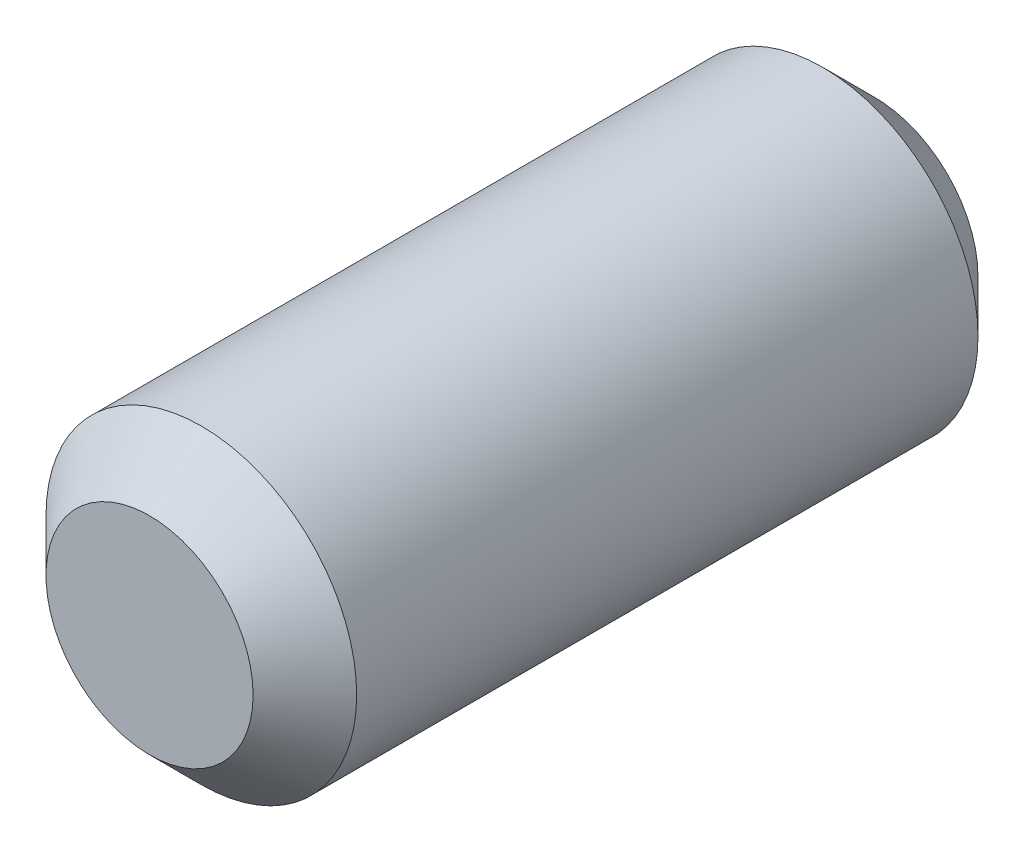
from build123d import *

# Parameters (mm, degrees)
ESQUISSE1_R          = 1.5
BASE_EXTRUSION_DEPTH = 7
CHANFREIN1_SIZE      = 0.5


with BuildPart() as part:
    # Esquisse1 → Base-Extrusion (new body)
    with BuildSketch(Plane.XY):
        Circle(ESQUISSE1_R)
    extrude(amount=BASE_EXTRUSION_DEPTH)

    # Chanfrein1
    chanfrein1_edges = [part.edges().sort_by_distance(p)[0] for p in [
        (-1.5, 0, 0),
        (-1.5, 0, 7),
    ]]
    chamfer(chanfrein1_edges, length=CHANFREIN1_SIZE)


solid = part.part
